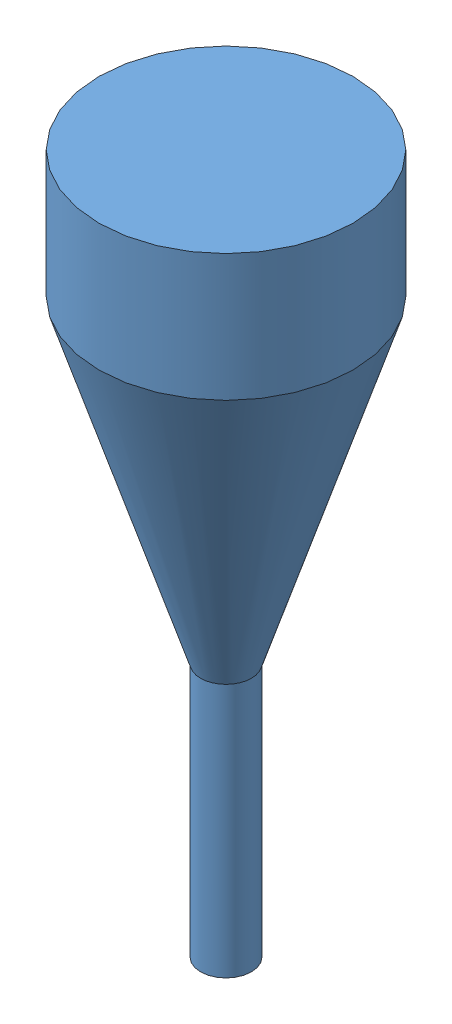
SolidWorks assembly MoldSetup.SLDASM, configuration Default (file format 11000). Lengths in mm.
Overall size (220 231.34 160).
5 component instances, 5 part files, 9 mates.
Components (placement in the parent):
- Sbox-1: Sbox.SLDPRT [Default] at origin size (220 113.5 160)
- MoldA-1: MoldA.SLDPRT [Default] at (0 44.27 0) size (194 42 134)
- MoldB-1: MoldB.SLDPRT [Default] at (0 163.6049 0) size (194 40 134)
- Donut-1: Donut.SLDPRT [Default] at (0 44.27 0) size (144 27.59 110.24)
- Funnel-1: Funnel.SLDPRT [Default] at (35.1735 196.3386 0.4833) size (20 55 20)
Mates (geometry in assembly coordinates):
- Parallel1: parallel: plane of Sbox-1 through (0 13 0) normal (0 1 0); plane of MoldA-1 through (0 14.27 0) normal (0 -1 0)
- Coincident2: coincident: plane of Sbox-1 through (-97 247.1338 -66.5) normal (1 0 0); plane of MoldA-1 through (-97 14.27 67) normal (-1 0 0)
- Coincident1: coincident: plane of Sbox-1 through (97 247.1338 -66.5) normal (-1 0 0); plane of MoldA-1 through (97 14.27 67) normal (1 0 0)
- Coincident3: coincident: plane of Sbox-1 through (-110 113.5 67) normal (0 0 -1); plane of MoldA-1 through (-97 14.27 67) normal (0 0 1)
- LimitDistance1: limit distance = 1.27 mm: plane of MoldA-1 through (0 14.27 0) normal (0 -1 0); plane of Sbox-1 through (0 13 0) normal (0 1 0)
- Coincident5: coincident: plane of Sbox-1 through (-97 247.1338 -66.5) normal (1 0 0); plane of MoldB-1 through (-97 203.6049 -67) normal (-1 0 0)
- Coincident6: coincident: plane of Sbox-1 through (-110 113.5 67) normal (0 0 -1); plane of MoldB-1 through (-97 203.6049 67) normal (0 0 1)
- LimitDistance2: limit distance = 119.3349 mm: plane of MoldB-1 through (0 163.6049 0) normal (0 -1 0); plane of MoldA-1 through (0 44.27 0) normal (0 1 0)
- Coincident9: coincident: point of MoldA-1; point of Donut-1
